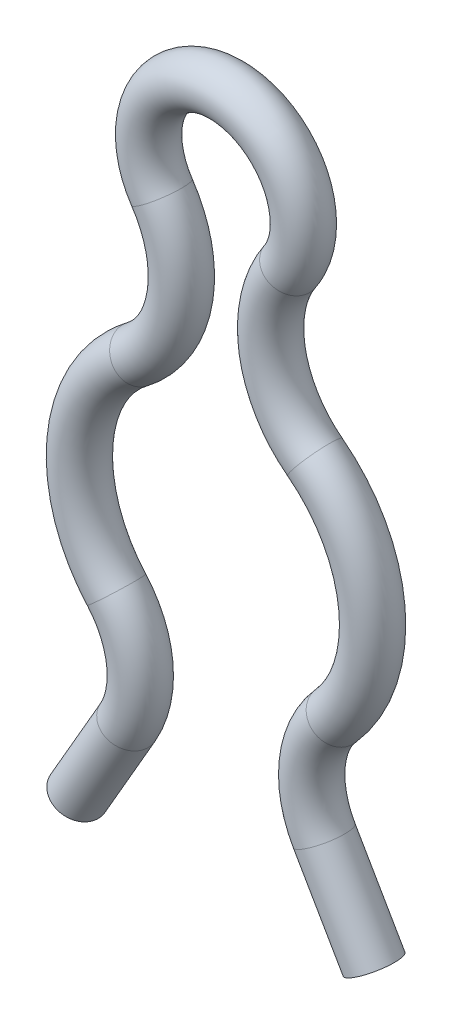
ISO-10303-21;
HEADER;
FILE_DESCRIPTION(('STEP AP214'),'2;1');
FILE_NAME('part.step','',(''),(''),'','','');
FILE_SCHEMA(('AUTOMOTIVE_DESIGN { 1 0 10303 214 1 1 1 1 }'));
ENDSEC;
DATA;
#1=APPLICATION_CONTEXT('core data for automotive mechanical design processes');
#2=APPLICATION_PROTOCOL_DEFINITION('international standard','automotive_design',2000,#1);
#3=PRODUCT_CONTEXT('',#1,'mechanical');
#4=PRODUCT('Part','Part','',(#3));
#5=PRODUCT_RELATED_PRODUCT_CATEGORY('part','',(#4));
#6=PRODUCT_DEFINITION_FORMATION('','',#4);
#7=PRODUCT_DEFINITION_CONTEXT('part definition',#1,'design');
#8=PRODUCT_DEFINITION('design','',#6,#7);
#9=PRODUCT_DEFINITION_SHAPE('','',#8);
#10=(LENGTH_UNIT() NAMED_UNIT(*) SI_UNIT(.MILLI.,.METRE.));
#11=(NAMED_UNIT(*) PLANE_ANGLE_UNIT() SI_UNIT($,.RADIAN.));
#12=(NAMED_UNIT(*) SI_UNIT($,.STERADIAN.) SOLID_ANGLE_UNIT());
#13=UNCERTAINTY_MEASURE_WITH_UNIT(LENGTH_MEASURE(1.E-05),#10,'distance_accuracy_value','');
#14=(GEOMETRIC_REPRESENTATION_CONTEXT(3) GLOBAL_UNCERTAINTY_ASSIGNED_CONTEXT((#13)) GLOBAL_UNIT_ASSIGNED_CONTEXT((#10,
#11,#12)) REPRESENTATION_CONTEXT('',''));
#15=CARTESIAN_POINT('',(0.,0.,0.));
#16=DIRECTION('',(0.,0.,1.));
#17=DIRECTION('',(1.,0.,0.));
#18=AXIS2_PLACEMENT_3D('',#15,#16,#17);
#19=CARTESIAN_POINT('',(1.59609728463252,-3.35976598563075,0.));
#20=DIRECTION('',(0.500000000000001,-0.866025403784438,0.));
#21=DIRECTION('',(0.866025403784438,0.500000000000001,0.));
#22=AXIS2_PLACEMENT_3D('',#19,#20,#21);
#23=CYLINDRICAL_SURFACE('',#22,0.381);
#24=CARTESIAN_POINT('',(1.59609728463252,-3.35976598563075,0.));
#25=DIRECTION('',(0.499999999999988,-0.866025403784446,0.));
#26=DIRECTION('',(0.866025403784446,0.499999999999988,0.));
#27=AXIS2_PLACEMENT_3D('',#24,#25,#26);
#28=CIRCLE('',#27,0.381);
#29=CARTESIAN_POINT('',(1.26614160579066,-3.55026598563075,0.));
#30=VERTEX_POINT('',#29);
#31=EDGE_CURVE('E41',#30,#30,#28,.T.);
#32=ORIENTED_EDGE('',*,*,#31,.T.);
#33=EDGE_LOOP('',(#32));
#34=FACE_BOUND('',#33,.T.);
#35=CARTESIAN_POINT('',(2.40596614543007,-4.76250000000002,0.));
#36=DIRECTION('',(0.499999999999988,-0.866025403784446,0.));
#37=DIRECTION('',(0.866025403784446,0.499999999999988,0.));
#38=AXIS2_PLACEMENT_3D('',#35,#36,#37);
#39=CIRCLE('',#38,0.381);
#40=CARTESIAN_POINT('',(2.73592182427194,-4.57200000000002,0.));
#41=VERTEX_POINT('',#40);
#42=EDGE_CURVE('E10',#41,#41,#39,.T.);
#43=ORIENTED_EDGE('',*,*,#42,.F.);
#44=EDGE_LOOP('',(#43));
#45=FACE_BOUND('',#44,.T.);
#46=ADVANCED_FACE('F35',(#34,#45),#23,.T.);
#47=CARTESIAN_POINT('',(2.91592,-2.59776598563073,0.));
#48=DIRECTION('',(0.,0.,1.));
#49=DIRECTION('',(1.,0.,0.));
#50=AXIS2_PLACEMENT_3D('',#47,#48,#49);
#51=TOROIDAL_SURFACE('',#50,1.524,0.381);
#52=CARTESIAN_POINT('',(1.77799999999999,-1.58400364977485,0.));
#53=DIRECTION('',(-0.665198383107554,-0.746666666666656,0.));
#54=DIRECTION('',(0.746666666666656,-0.665198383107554,0.));
#55=AXIS2_PLACEMENT_3D('',#52,#53,#54);
#56=CIRCLE('',#55,0.381);
#57=CARTESIAN_POINT('',(1.49351999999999,-1.33056306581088,0.));
#58=VERTEX_POINT('',#57);
#59=EDGE_CURVE('E45',#58,#58,#56,.T.);
#60=CARTESIAN_POINT('',(2.91592,-2.59776598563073,0.));
#61=DIRECTION('',(0.,0.,1.));
#62=DIRECTION('',(1.,0.,0.));
#63=AXIS2_PLACEMENT_3D('',#60,#61,#62);
#64=CIRCLE('',#63,1.905);
#65=EDGE_CURVE('',#58,#30,#64,.T.);
#66=ORIENTED_EDGE('',*,*,#59,.T.);
#67=ORIENTED_EDGE('',*,*,#31,.F.);
#68=ORIENTED_EDGE('',*,*,#65,.T.);
#69=ORIENTED_EDGE('',*,*,#65,.F.);
#70=EDGE_LOOP('',(#66,#68,#67,#69));
#71=FACE_BOUND('',#70,.T.);
#72=ADVANCED_FACE('F91',(#71),#51,.T.);
#73=CARTESIAN_POINT('',(0.,0.,0.));
#74=DIRECTION('',(0.,0.,-1.));
#75=DIRECTION('',(-1.,0.,0.));
#76=AXIS2_PLACEMENT_3D('',#73,#74,#75);
#77=TOROIDAL_SURFACE('',#76,2.38125,0.381);
#78=CARTESIAN_POINT('',(1.44437984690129,1.89317680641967,0.));
#79=DIRECTION('',(0.795034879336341,-0.606563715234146,0.));
#80=DIRECTION('',(0.606563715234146,0.795034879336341,0.));
#81=AXIS2_PLACEMENT_3D('',#78,#79,#80);
#82=CIRCLE('',#81,0.381);
#83=CARTESIAN_POINT('',(1.21327907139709,1.59026851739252,0.));
#84=VERTEX_POINT('',#83);
#85=EDGE_CURVE('E49',#84,#84,#82,.T.);
#86=ORIENTED_EDGE('',*,*,#85,.T.);
#87=EDGE_LOOP('',(#86));
#88=FACE_BOUND('',#87,.T.);
#89=ORIENTED_EDGE('',*,*,#59,.F.);
#90=EDGE_LOOP('',(#89));
#91=FACE_BOUND('',#90,.T.);
#92=ADVANCED_FACE('F95',(#88,#91),#77,.T.);
#93=CARTESIAN_POINT('',(2.55366356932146,3.34713659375,0.));
#94=DIRECTION('',(0.,0.,1.));
#95=DIRECTION('',(1.,0.,0.));
#96=AXIS2_PLACEMENT_3D('',#93,#94,#95);
#97=TOROIDAL_SURFACE('',#96,1.8288,0.381);
#98=CARTESIAN_POINT('',(1.04038145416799,4.37401861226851,0.));
#99=DIRECTION('',(-0.561505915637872,-0.827472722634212,0.));
#100=DIRECTION('',(0.827472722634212,-0.561505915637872,0.));
#101=AXIS2_PLACEMENT_3D('',#98,#99,#100);
#102=CIRCLE('',#101,0.381);
#103=CARTESIAN_POINT('',(0.725114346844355,4.58795236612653,0.));
#104=VERTEX_POINT('',#103);
#105=EDGE_CURVE('E54',#104,#104,#102,.T.);
#106=CARTESIAN_POINT('',(2.55366356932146,3.34713659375,0.));
#107=DIRECTION('',(0.,0.,1.));
#108=DIRECTION('',(1.,0.,0.));
#109=AXIS2_PLACEMENT_3D('',#106,#107,#108);
#110=CIRCLE('',#109,2.2098);
#111=EDGE_CURVE('',#104,#84,#110,.T.);
#112=ORIENTED_EDGE('',*,*,#105,.T.);
#113=ORIENTED_EDGE('',*,*,#85,.F.);
#114=ORIENTED_EDGE('',*,*,#111,.T.);
#115=ORIENTED_EDGE('',*,*,#111,.F.);
#116=EDGE_LOOP('',(#112,#114,#113,#115));
#117=FACE_BOUND('',#116,.T.);
#118=ADVANCED_FACE('F101',(#117),#97,.T.);
#119=CARTESIAN_POINT('',(0.,5.08,0.));
#120=DIRECTION('',(0.,0.,-1.));
#121=DIRECTION('',(-1.,0.,0.));
#122=AXIS2_PLACEMENT_3D('',#119,#120,#121);
#123=TOROIDAL_SURFACE('',#122,1.2573,0.381);
#124=CARTESIAN_POINT('',(-1.040381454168,4.37401861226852,0.));
#125=DIRECTION('',(-0.561505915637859,0.827472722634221,0.));
#126=DIRECTION('',(-0.827472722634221,-0.561505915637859,0.));
#127=AXIS2_PLACEMENT_3D('',#124,#125,#126);
#128=CIRCLE('',#127,0.381);
#129=CARTESIAN_POINT('',(-0.725114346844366,4.58795236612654,0.));
#130=VERTEX_POINT('',#129);
#131=EDGE_CURVE('E57',#130,#130,#128,.T.);
#132=ORIENTED_EDGE('',*,*,#131,.T.);
#133=EDGE_LOOP('',(#132));
#134=FACE_BOUND('',#133,.T.);
#135=ORIENTED_EDGE('',*,*,#105,.F.);
#136=EDGE_LOOP('',(#135));
#137=FACE_BOUND('',#136,.T.);
#138=ADVANCED_FACE('F108',(#134,#137),#123,.T.);
#139=CARTESIAN_POINT('',(-2.55366356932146,3.34713659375,0.));
#140=DIRECTION('',(0.,0.,1.));
#141=DIRECTION('',(1.,0.,0.));
#142=AXIS2_PLACEMENT_3D('',#139,#140,#141);
#143=TOROIDAL_SURFACE('',#142,1.8288,0.381);
#144=CARTESIAN_POINT('',(-1.44437984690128,1.89317680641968,0.));
#145=DIRECTION('',(0.795034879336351,0.606563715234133,0.));
#146=DIRECTION('',(-0.606563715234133,0.795034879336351,0.));
#147=AXIS2_PLACEMENT_3D('',#144,#145,#146);
#148=CIRCLE('',#147,0.381);
#149=CARTESIAN_POINT('',(-1.21327907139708,1.59026851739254,0.));
#150=VERTEX_POINT('',#149);
#151=EDGE_CURVE('E60',#150,#150,#148,.T.);
#152=CARTESIAN_POINT('',(-2.55366356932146,3.34713659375,0.));
#153=DIRECTION('',(0.,0.,1.));
#154=DIRECTION('',(1.,0.,0.));
#155=AXIS2_PLACEMENT_3D('',#152,#153,#154);
#156=CIRCLE('',#155,2.2098);
#157=EDGE_CURVE('',#150,#130,#156,.T.);
#158=ORIENTED_EDGE('',*,*,#151,.T.);
#159=ORIENTED_EDGE('',*,*,#131,.F.);
#160=ORIENTED_EDGE('',*,*,#157,.T.);
#161=ORIENTED_EDGE('',*,*,#157,.F.);
#162=EDGE_LOOP('',(#158,#160,#159,#161));
#163=FACE_BOUND('',#162,.T.);
#164=ADVANCED_FACE('F112',(#163),#143,.T.);
#165=CARTESIAN_POINT('',(0.,0.,0.));
#166=DIRECTION('',(0.,0.,-1.));
#167=DIRECTION('',(-1.,0.,0.));
#168=AXIS2_PLACEMENT_3D('',#165,#166,#167);
#169=TOROIDAL_SURFACE('',#168,2.38125,0.381);
#170=CARTESIAN_POINT('',(-1.778,-1.58400364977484,0.));
#171=DIRECTION('',(-0.665198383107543,0.746666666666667,0.));
#172=DIRECTION('',(-0.746666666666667,-0.665198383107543,0.));
#173=AXIS2_PLACEMENT_3D('',#170,#171,#172);
#174=CIRCLE('',#173,0.381);
#175=CARTESIAN_POINT('',(-1.49352,-1.33056306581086,0.));
#176=VERTEX_POINT('',#175);
#177=EDGE_CURVE('E63',#176,#176,#174,.T.);
#178=ORIENTED_EDGE('',*,*,#177,.T.);
#179=EDGE_LOOP('',(#178));
#180=FACE_BOUND('',#179,.T.);
#181=ORIENTED_EDGE('',*,*,#151,.F.);
#182=EDGE_LOOP('',(#181));
#183=FACE_BOUND('',#182,.T.);
#184=ADVANCED_FACE('F116',(#180,#183),#169,.T.);
#185=CARTESIAN_POINT('',(-2.91592,-2.59776598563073,0.));
#186=DIRECTION('',(0.,0.,1.));
#187=DIRECTION('',(1.,0.,0.));
#188=AXIS2_PLACEMENT_3D('',#185,#186,#187);
#189=TOROIDAL_SURFACE('',#188,1.524,0.381);
#190=CARTESIAN_POINT('',(-1.59609728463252,-3.35976598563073,0.));
#191=DIRECTION('',(0.500000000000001,0.866025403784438,0.));
#192=DIRECTION('',(-0.866025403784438,0.500000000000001,0.));
#193=AXIS2_PLACEMENT_3D('',#190,#191,#192);
#194=CIRCLE('',#193,0.381);
#195=CARTESIAN_POINT('',(-1.26614160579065,-3.55026598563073,0.));
#196=VERTEX_POINT('',#195);
#197=EDGE_CURVE('E66',#196,#196,#194,.T.);
#198=CARTESIAN_POINT('',(-2.91592,-2.59776598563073,0.));
#199=DIRECTION('',(0.,0.,1.));
#200=DIRECTION('',(1.,0.,0.));
#201=AXIS2_PLACEMENT_3D('',#198,#199,#200);
#202=CIRCLE('',#201,1.905);
#203=EDGE_CURVE('',#196,#176,#202,.T.);
#204=ORIENTED_EDGE('',*,*,#197,.T.);
#205=ORIENTED_EDGE('',*,*,#177,.F.);
#206=ORIENTED_EDGE('',*,*,#203,.T.);
#207=ORIENTED_EDGE('',*,*,#203,.F.);
#208=EDGE_LOOP('',(#204,#206,#205,#207));
#209=FACE_BOUND('',#208,.T.);
#210=ADVANCED_FACE('F73',(#209),#189,.T.);
#211=CARTESIAN_POINT('',(-1.59609728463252,-3.35976598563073,0.));
#212=DIRECTION('',(-0.500000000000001,-0.866025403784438,0.));
#213=DIRECTION('',(0.866025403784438,-0.500000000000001,0.));
#214=AXIS2_PLACEMENT_3D('',#211,#212,#213);
#215=CYLINDRICAL_SURFACE('',#214,0.381);
#216=ORIENTED_EDGE('',*,*,#197,.F.);
#217=EDGE_LOOP('',(#216));
#218=FACE_BOUND('',#217,.T.);
#219=CARTESIAN_POINT('',(-2.40596614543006,-4.7625,0.));
#220=DIRECTION('',(0.500000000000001,0.866025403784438,0.));
#221=DIRECTION('',(-0.866025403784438,0.500000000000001,0.));
#222=AXIS2_PLACEMENT_3D('',#219,#220,#221);
#223=CIRCLE('',#222,0.381);
#224=CARTESIAN_POINT('',(-2.73592182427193,-4.572,0.));
#225=VERTEX_POINT('',#224);
#226=EDGE_CURVE('E67',#225,#225,#223,.T.);
#227=ORIENTED_EDGE('',*,*,#226,.T.);
#228=EDGE_LOOP('',(#227));
#229=FACE_BOUND('',#228,.T.);
#230=ADVANCED_FACE('F76',(#218,#229),#215,.T.);
#231=CARTESIAN_POINT('',(2.40596614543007,-4.76250000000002,0.));
#232=DIRECTION('',(0.499999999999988,-0.866025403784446,0.));
#233=DIRECTION('',(0.866025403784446,0.499999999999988,0.));
#234=AXIS2_PLACEMENT_3D('',#231,#232,#233);
#235=PLANE('',#234);
#236=ORIENTED_EDGE('',*,*,#42,.T.);
#237=EDGE_LOOP('',(#236));
#238=FACE_BOUND('',#237,.T.);
#239=ADVANCED_FACE('F79',(#238),#235,.T.);
#240=CARTESIAN_POINT('',(-2.40596614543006,-4.7625,0.));
#241=DIRECTION('',(0.500000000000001,0.866025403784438,0.));
#242=DIRECTION('',(-0.866025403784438,0.500000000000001,0.));
#243=AXIS2_PLACEMENT_3D('',#240,#241,#242);
#244=PLANE('',#243);
#245=ORIENTED_EDGE('',*,*,#226,.F.);
#246=EDGE_LOOP('',(#245));
#247=FACE_BOUND('',#246,.T.);
#248=ADVANCED_FACE('F83',(#247),#244,.F.);
#249=CLOSED_SHELL('',(#46,#72,#92,#118,#138,#164,#184,#210,#230,#239,#248));
#250=MANIFOLD_SOLID_BREP('B2',#249);
#251=ADVANCED_BREP_SHAPE_REPRESENTATION('',(#18,#250),#14);
#252=SHAPE_DEFINITION_REPRESENTATION(#9,#251);
ENDSEC;
END-ISO-10303-21;
